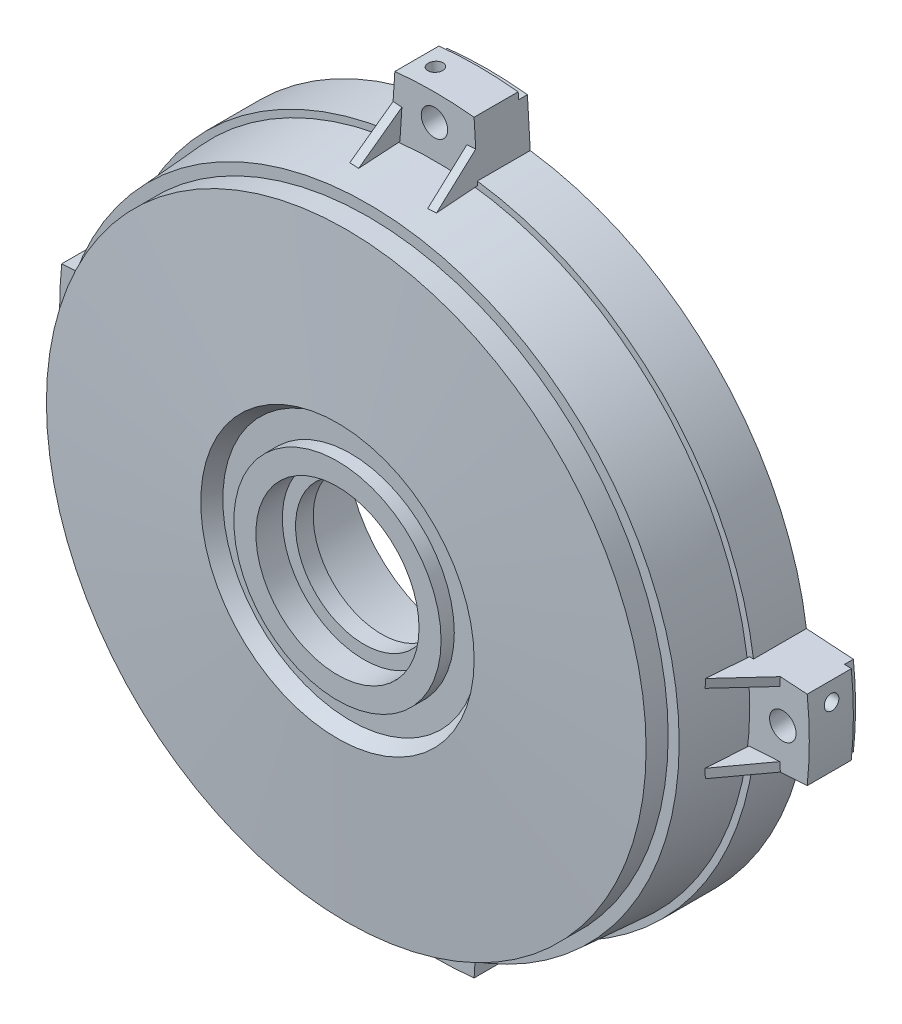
from build123d import *

# Parameters (mm, degrees)
SKETCH_2_R               = 70
CUT_EXTRUDE_1_DEPTH      = 4
EXTRUDE_1_DEPTH          = 12
PATTERN_CIRCULAR_1_COUNT = 4
SKETCH_4_OUTSIDE_W       = 220.562
SKETCH_4_OUTSIDE_H       = 220.562
SKETCH_4_OUTSIDE_R       = 83.5
CUT_EXTRUDE_2_DEPTH      = 2
SKETCH_7_W               = 3
SKETCH_7_H               = 4
PATTERN_CIRCULAR_3_COUNT = 8
SKETCH_8_R               = 5
EXTRUDE_2_DEPTH          = 22
PATTERN_CIRCULAR_4_COUNT = 3
PATTERN_CIRCULAR_5_COUNT = 3
PATTERN_CIRCULAR_6_COUNT = 4
EXTRUDE_3_DEPTH          = 2
PATTERN_CIRCULAR_7_COUNT = 4
EXTRUDE_4_DEPTH          = 2
PATTERN_CIRCULAR_8_COUNT = 4
SKETCH_14_R              = 3
CUT_EXTRUDE_5_DEPTH      = 30
PATTERN_CIRCULAR_9_COUNT = 4


with BuildPart() as part:
    # Sketch 1 → Revolve 1 (revolve)
    with BuildSketch(Plane(origin=(0, 0, 0), x_dir=(1, 0, 0), z_dir=(0, 1, 0))):
        with BuildLine():
            Line((15.5, 5.088378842), (22.5, 5.088378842))
            Line((22.5, 5.088378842), (22.5, 6.088378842))
            Line((22.5, 6.088378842), (26, 6.088378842))
            Line((26, 6.088378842), (26, 23.088378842))
            Line((26, 23.088378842), (34, 23.088378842))
            Line((34, 23.088378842), (34, 4.03322004))
            ThreePointArc((34, 4.03322004), (35.561205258, 0.403524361), (39.26987629, -0.959491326))
            Line((39.26987629, -0.959491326), (64.5, 0.404299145))
            Line((64.5, 0.404299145), (64.5, 5.588378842))
            Line((64.5, 5.588378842), (67.233333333, 5.588378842))
            Line((67.233333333, 5.588378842), (70, 29.088378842))
            Line((70, 29.088378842), (73, 29.088378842))
            Line((73, 29.088378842), (73, 17.088378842))
            Line((73, 17.088378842), (71.5, 17.088378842))
            Line((71.5, 17.088378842), (70.5, 2.088378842))
            Line((70.5, 2.088378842), (68, 2.088378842))
            Line((68, 2.088378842), (68, -2.911621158))
            Line((68, -2.911621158), (31, -4.911621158))
            Line((31, -4.911621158), (29, -1.911621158))
            Line((29, -1.911621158), (23.5, -1.911621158))
            Line((23.5, -1.911621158), (23.5, -4.911621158))
            Line((23.5, -4.911621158), (18.5, -4.911621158))
            Line((18.5, -4.911621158), (18.5, 1.088378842))
            Line((18.5, 1.088378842), (15.5, 1.088378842))
            Line((15.5, 1.088378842), (15.5, 5.088378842))
        make_face()
    revolve(axis=Axis((0, 0, 0), (0, 0, -1)))

    # Sketch 2 → Cut-Extrude 1 (cut)
    with BuildSketch(Plane(origin=(0, 0, -29.088378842), x_dir=(-1, 0, 0), z_dir=(0, 0, -1))):
        Circle(SKETCH_2_R)
    extrude(amount=-CUT_EXTRUDE_1_DEPTH, mode=Mode.SUBTRACT)

    # Sketch 3 → Extrude 1 (add)
    with BuildSketch(Plane(origin=(0, 0, -29.088378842), x_dir=(-1, 0, 0), z_dir=(0, 0, -1))):
        with BuildLine():
            Line((-8.987378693, 84.523529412), (-9.900914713, 69.296261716))
            ThreePointArc((-9.900914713, 69.296261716), (0.037147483, 69.999990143), (9.974457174, 69.285714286))
            Line((9.974457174, 69.285714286), (8.987378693, 84.523529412))
            ThreePointArc((8.987378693, 84.523529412), (0, 85), (-8.987378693, 84.523529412))
        make_face()
    extrude_1 = extrude(amount=-EXTRUDE_1_DEPTH)

    # Pattern Circular 1: Extrude 1 ×4 about axis
    pattern_circular_1_axis = Axis((0, 0, 0), (0, 0, 1))
    for i in range(1, PATTERN_CIRCULAR_1_COUNT):
        add(extrude_1.rotate(pattern_circular_1_axis, i * 360 / PATTERN_CIRCULAR_1_COUNT))

    # Sketch 4 outside → Cut-Extrude 2 (cut)
    with BuildSketch(Plane(origin=(0, 0, -29.088378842), x_dir=(-1, 0, 0), z_dir=(0, 0, -1))):
        Rectangle(SKETCH_4_OUTSIDE_W, SKETCH_4_OUTSIDE_H)
        Circle(SKETCH_4_OUTSIDE_R, mode=Mode.SUBTRACT)
    extrude(amount=-CUT_EXTRUDE_2_DEPTH, mode=Mode.SUBTRACT)

    # Sweep 1: sweep along a path in Sketch 6
    with BuildLine(Plane(origin=(0, 0, 0), x_dir=(1, 0, 0), z_dir=(0, 1, 0))) as sweep_1_path:
        Line((-64.546448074, 0.425171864), (-33.276692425, -1.405682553))
    # Sketch 7 → Sweep 1 (sweep)
    with BuildSketch(Plane(origin=(-64.546448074, 0, -0.425171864), x_dir=(0.058450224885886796, 0, -0.9982903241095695), z_dir=(0.9982903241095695, 0, 0.058450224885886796))):
        with Locations((1.406592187, 0)):
            Rectangle(SKETCH_7_W, SKETCH_7_H)
    sweep_1 = sweep(path=sweep_1_path.line)

    # Pattern Circular 3: Sweep 1 ×8 about axis
    pattern_circular_3_axis = Axis((0, 0, 0), (0, 0, 1))
    for i in range(1, PATTERN_CIRCULAR_3_COUNT):
        add(sweep_1.rotate(pattern_circular_3_axis, i * 360 / PATTERN_CIRCULAR_3_COUNT))

    # Sketch 8 → Extrude 2 (add)
    with BuildSketch(Plane(origin=(0, 0, -23.088378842), x_dir=(-1, 0, 0), z_dir=(0, 0, -1))):
        with Locations((0, 31)):
            Circle(SKETCH_8_R)
    extrude_2 = extrude(amount=-EXTRUDE_2_DEPTH)

    # Pattern Circular 4: Extrude 2 ×3 about axis
    pattern_circular_4_axis = Axis((0, 0, 0), (0, 0, 1))
    for i in range(1, PATTERN_CIRCULAR_4_COUNT):
        add(extrude_2.rotate(pattern_circular_4_axis, i * 360 / PATTERN_CIRCULAR_4_COUNT))

    # Cut-Extrude 4 cone 1 section (on through the dimple's axis) → Cut-Extrude 4 (revolve, cut)
    with BuildSketch(Plane(origin=(0, 31, -23.088378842), x_dir=(0, 1, 0), z_dir=(1, 0, 0))):
        Polygon((0, 0), (2.05, 0), (0, 2.05), align=None)
    cut_extrude_4 = revolve(axis=Axis((0, 31, -23.088378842), (0, 0, 1)), mode=Mode.SUBTRACT)

    # Pattern Circular 5: Cut-Extrude 4 ×3 about axis
    pattern_circular_5_axis = Axis((0, 0, 0), (0, 0, 1))
    for i in range(1, PATTERN_CIRCULAR_5_COUNT):
        add(cut_extrude_4.rotate(pattern_circular_5_axis, i * 360 / PATTERN_CIRCULAR_5_COUNT), mode=Mode.SUBTRACT)

    # Sketch 10 → Hole Wizard M4 _1 (revolve, cut)
    with BuildSketch(Plane(origin=(84.854271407, 4.975200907, -22.286352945), x_dir=(-0.05853177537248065, 0.9982855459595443, 0), z_dir=(0, 0, 1))):
        Polygon((0, 0), (0, 9.991420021), (1.65, 9), (1.65, 0), align=None)
    hole_wizard_m4_1 = revolve(axis=Axis((91.193384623, 5.34687768, -22.286352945), (-0.9982855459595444, -0.05853177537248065, 0)), mode=Mode.SUBTRACT)

    # Pattern Circular 6: Hole Wizard M4 _1 ×4 about axis
    pattern_circular_6_axis = Axis((0, 0, 0), (0, 0, 1))
    for i in range(1, PATTERN_CIRCULAR_6_COUNT):
        add(hole_wizard_m4_1.rotate(pattern_circular_6_axis, i * 360 / PATTERN_CIRCULAR_6_COUNT), mode=Mode.SUBTRACT)

    # Sketch 11 → Extrude 3 (add)
    with BuildSketch(Plane(origin=(14.00781804, 0.840377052, 0), x_dir=(0, 0, -1), z_dir=(0.9982052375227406, 0.05988575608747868, 0))):
        Polygon((17.088378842, 77.736057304), (7.730757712, 70.080160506), (17.088378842, 70.765863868), align=None)
    extrude_3 = extrude(amount=-EXTRUDE_3_DEPTH)

    # Pattern Circular 7: Extrude 3 ×4 about axis
    pattern_circular_7_axis = Axis((0, 0, 0), (0, 0, 1))
    for i in range(1, PATTERN_CIRCULAR_7_COUNT):
        add(extrude_3.rotate(pattern_circular_7_axis, i * 360 / PATTERN_CIRCULAR_7_COUNT))

    # Sketch 12 → Extrude 4 (add)
    with BuildSketch(Plane(origin=(-14.40222727, 0.93295059, 0), x_dir=(0, 0, 1), z_dir=(-0.9979084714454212, 0.06464273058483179, 0))):
        Polygon((-17.088378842, 77.662440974), (-17.088378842, 70.676059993), (-7.766656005, 70.041516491), align=None)
    extrude_4 = extrude(amount=-EXTRUDE_4_DEPTH)

    # Pattern Circular 8: Extrude 4 ×4 about axis
    pattern_circular_8_axis = Axis((0, 0, 0), (0, 0, 1))
    for i in range(1, PATTERN_CIRCULAR_8_COUNT):
        add(extrude_4.rotate(pattern_circular_8_axis, i * 360 / PATTERN_CIRCULAR_8_COUNT))

    # Sketch 14 → Cut-Extrude 5 (cut)
    with BuildSketch(Plane(origin=(0, 0, -29.088378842), x_dir=(-1, 0, 0), z_dir=(0, 0, -1))):
        with Locations((0, 79)):
            Circle(SKETCH_14_R)
    cut_extrude_5 = extrude(amount=-CUT_EXTRUDE_5_DEPTH, mode=Mode.SUBTRACT)

    # Pattern Circular 9: Cut-Extrude 5 ×4 about axis
    pattern_circular_9_axis = Axis((0, 0, 0), (0, 0, 1))
    for i in range(1, PATTERN_CIRCULAR_9_COUNT):
        add(cut_extrude_5.rotate(pattern_circular_9_axis, i * 360 / PATTERN_CIRCULAR_9_COUNT), mode=Mode.SUBTRACT)


solid = part.part
